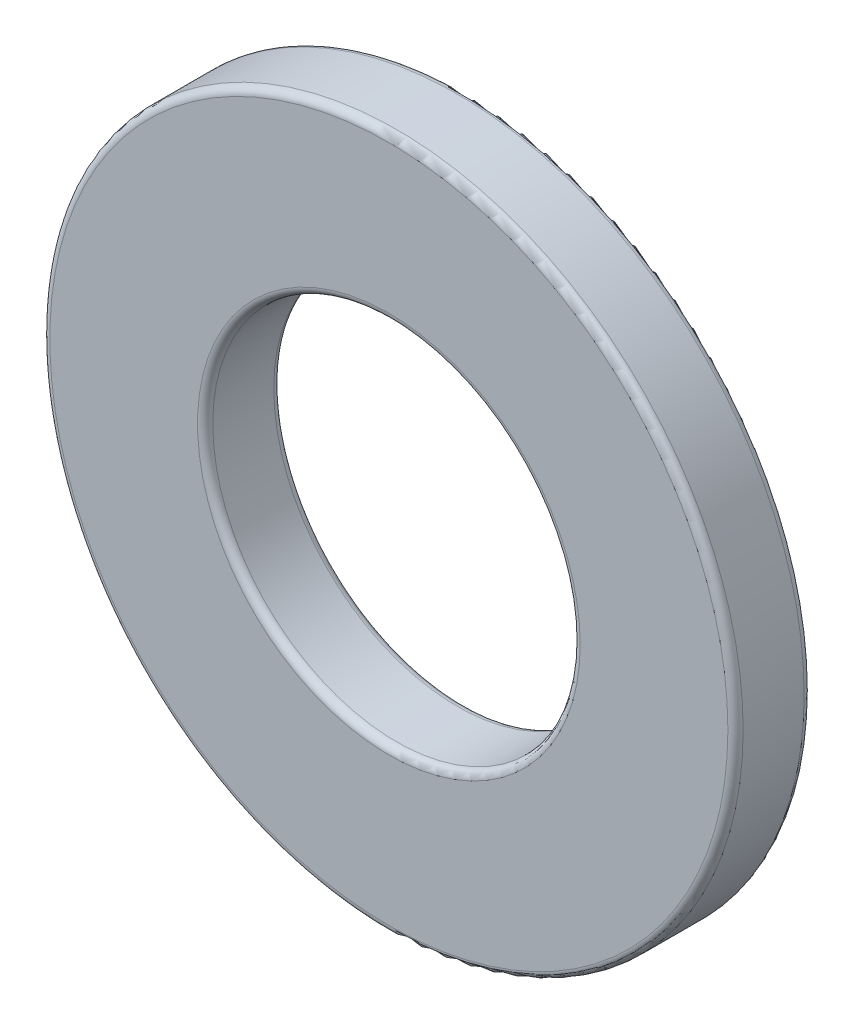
from build123d import *

# Parameters (mm, degrees)
BOSS_EXTRUDE1_DEPTH      = 0.55
BOSS_EXTRUDE1_DEPTH_BACK = 0.55
SKETCH3_R                = 5
SKETCH3_R_2              = 2.65
FILLET1_R                = 0.11


with BuildPart() as part:
    # Sketch3 → Boss-Extrude1 (new, two sides: drawn at the far end of the back side and taken through both)
    with BuildSketch(Plane.XY.offset(-BOSS_EXTRUDE1_DEPTH_BACK)):
        Circle(SKETCH3_R)
        Circle(SKETCH3_R_2, mode=Mode.SUBTRACT)
    extrude(amount=BOSS_EXTRUDE1_DEPTH + BOSS_EXTRUDE1_DEPTH_BACK)

    # Fillet1
    fillet1_edges = [part.edges().sort_by_distance(p)[0] for p in [
        (-5, 0, -0.55),
        (-2.65, 0, -0.55),
        (-5, 0, 0.55),
        (-2.65, 0, 0.55),
    ]]
    fillet(fillet1_edges, radius=FILLET1_R)


solid = part.part
